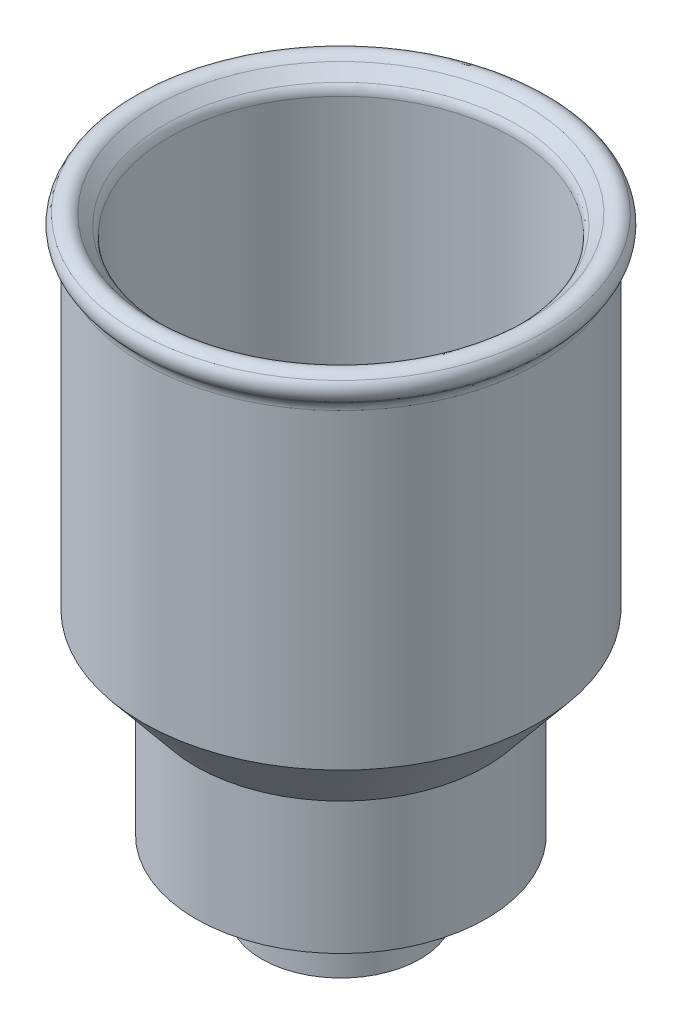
ISO-10303-21;
HEADER;
FILE_DESCRIPTION(('STEP AP214'),'2;1');
FILE_NAME('part.step','',(''),(''),'','','');
FILE_SCHEMA(('AUTOMOTIVE_DESIGN { 1 0 10303 214 1 1 1 1 }'));
ENDSEC;
DATA;
#1=APPLICATION_CONTEXT('core data for automotive mechanical design processes');
#2=APPLICATION_PROTOCOL_DEFINITION('international standard','automotive_design',2000,#1);
#3=PRODUCT_CONTEXT('',#1,'mechanical');
#4=PRODUCT('Part','Part','',(#3));
#5=PRODUCT_RELATED_PRODUCT_CATEGORY('part','',(#4));
#6=PRODUCT_DEFINITION_FORMATION('','',#4);
#7=PRODUCT_DEFINITION_CONTEXT('part definition',#1,'design');
#8=PRODUCT_DEFINITION('design','',#6,#7);
#9=PRODUCT_DEFINITION_SHAPE('','',#8);
#10=(LENGTH_UNIT() NAMED_UNIT(*) SI_UNIT(.MILLI.,.METRE.));
#11=(NAMED_UNIT(*) PLANE_ANGLE_UNIT() SI_UNIT($,.RADIAN.));
#12=(NAMED_UNIT(*) SI_UNIT($,.STERADIAN.) SOLID_ANGLE_UNIT());
#13=UNCERTAINTY_MEASURE_WITH_UNIT(LENGTH_MEASURE(1.E-05),#10,'distance_accuracy_value','');
#14=(GEOMETRIC_REPRESENTATION_CONTEXT(3) GLOBAL_UNCERTAINTY_ASSIGNED_CONTEXT((#13)) GLOBAL_UNIT_ASSIGNED_CONTEXT((#10,
#11,#12)) REPRESENTATION_CONTEXT('',''));
#15=CARTESIAN_POINT('',(0.,0.,0.));
#16=DIRECTION('',(0.,0.,1.));
#17=DIRECTION('',(1.,0.,0.));
#18=AXIS2_PLACEMENT_3D('',#15,#16,#17);
#19=CARTESIAN_POINT('',(3.88902869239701,27.8652560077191,0.));
#20=DIRECTION('',(0.,1.,0.));
#21=DIRECTION('',(0.,0.,1.));
#22=AXIS2_PLACEMENT_3D('',#19,#20,#21);
#23=CONICAL_SURFACE('',#22,6.5,0.785398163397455);
#24=CARTESIAN_POINT('',(3.88902869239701,28.0117026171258,0.));
#25=DIRECTION('',(0.,-1.,0.));
#26=DIRECTION('',(0.,0.,-1.));
#27=AXIS2_PLACEMENT_3D('',#24,#25,#26);
#28=CIRCLE('',#27,6.64644660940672);
#29=CARTESIAN_POINT('',(3.88902869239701,28.0117026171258,-6.64644660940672));
#30=VERTEX_POINT('',#29);
#31=EDGE_CURVE('E43',#30,#30,#28,.T.);
#32=ORIENTED_EDGE('',*,*,#31,.T.);
#33=EDGE_LOOP('',(#32));
#34=FACE_BOUND('',#33,.T.);
#35=CARTESIAN_POINT('',(3.88902869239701,28.4106623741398,0.));
#36=DIRECTION('',(0.,1.,0.));
#37=DIRECTION('',(0.,0.,1.));
#38=AXIS2_PLACEMENT_3D('',#35,#36,#37);
#39=CIRCLE('',#38,7.04540636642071);
#40=CARTESIAN_POINT('',(3.88902869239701,28.4106623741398,7.04540636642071));
#41=VERTEX_POINT('',#40);
#42=EDGE_CURVE('E48',#41,#41,#39,.T.);
#43=ORIENTED_EDGE('',*,*,#42,.T.);
#44=EDGE_LOOP('',(#43));
#45=FACE_BOUND('',#44,.T.);
#46=ADVANCED_FACE('F29',(#34,#45),#23,.F.);
#47=CARTESIAN_POINT('',(3.88902869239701,30.3420069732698,0.));
#48=DIRECTION('',(0.,1.,0.));
#49=DIRECTION('',(0.,0.,1.));
#50=AXIS2_PLACEMENT_3D('',#47,#48,#49);
#51=CYLINDRICAL_SURFACE('',#50,6.5);
#52=CARTESIAN_POINT('',(3.88902869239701,27.6581492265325,0.));
#53=DIRECTION('',(0.,-1.,0.));
#54=DIRECTION('',(0.,0.,-1.));
#55=AXIS2_PLACEMENT_3D('',#52,#53,#54);
#56=CIRCLE('',#55,6.5);
#57=CARTESIAN_POINT('',(3.88902869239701,27.6581492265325,-6.5));
#58=VERTEX_POINT('',#57);
#59=EDGE_CURVE('E51',#58,#58,#56,.F.);
#60=ORIENTED_EDGE('',*,*,#59,.T.);
#61=EDGE_LOOP('',(#60));
#62=FACE_BOUND('',#61,.T.);
#63=CARTESIAN_POINT('',(3.88902869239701,15.8097667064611,0.));
#64=DIRECTION('',(0.,1.,0.));
#65=DIRECTION('',(0.,0.,1.));
#66=AXIS2_PLACEMENT_3D('',#63,#64,#65);
#67=CIRCLE('',#66,6.5);
#68=CARTESIAN_POINT('',(3.88902869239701,15.8097667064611,6.5));
#69=VERTEX_POINT('',#68);
#70=EDGE_CURVE('E54',#69,#69,#67,.T.);
#71=ORIENTED_EDGE('',*,*,#70,.F.);
#72=EDGE_LOOP('',(#71));
#73=FACE_BOUND('',#72,.T.);
#74=ADVANCED_FACE('F107',(#62,#73),#51,.F.);
#75=CARTESIAN_POINT('',(3.88902869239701,13.3808345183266,0.));
#76=DIRECTION('',(0.,1.,0.));
#77=DIRECTION('',(0.,0.,1.));
#78=AXIS2_PLACEMENT_3D('',#75,#76,#77);
#79=CONICAL_SURFACE('',#78,4.49999999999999,0.688851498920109);
#80=ORIENTED_EDGE('',*,*,#70,.T.);
#81=EDGE_LOOP('',(#80));
#82=FACE_BOUND('',#81,.T.);
#83=CARTESIAN_POINT('',(3.88902869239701,13.3808345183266,0.));
#84=DIRECTION('',(0.,1.,0.));
#85=DIRECTION('',(0.,0.,1.));
#86=AXIS2_PLACEMENT_3D('',#83,#84,#85);
#87=CIRCLE('',#86,4.49999999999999);
#88=CARTESIAN_POINT('',(3.88902869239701,13.3808345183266,4.49999999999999));
#89=VERTEX_POINT('',#88);
#90=EDGE_CURVE('E57',#89,#89,#87,.T.);
#91=ORIENTED_EDGE('',*,*,#90,.F.);
#92=EDGE_LOOP('',(#91));
#93=FACE_BOUND('',#92,.T.);
#94=ADVANCED_FACE('F112',(#82,#93),#79,.F.);
#95=CARTESIAN_POINT('',(3.88902869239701,30.3420069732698,0.));
#96=DIRECTION('',(0.,1.,0.));
#97=DIRECTION('',(0.,0.,1.));
#98=AXIS2_PLACEMENT_3D('',#95,#96,#97);
#99=CYLINDRICAL_SURFACE('',#98,4.49999999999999);
#100=ORIENTED_EDGE('',*,*,#90,.T.);
#101=EDGE_LOOP('',(#100));
#102=FACE_BOUND('',#101,.T.);
#103=CARTESIAN_POINT('',(3.88902869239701,9.02211025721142,0.));
#104=DIRECTION('',(0.,1.,0.));
#105=DIRECTION('',(0.,0.,1.));
#106=AXIS2_PLACEMENT_3D('',#103,#104,#105);
#107=CIRCLE('',#106,4.49999999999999);
#108=CARTESIAN_POINT('',(3.88902869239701,9.02211025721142,4.49999999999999));
#109=VERTEX_POINT('',#108);
#110=EDGE_CURVE('E60',#109,#109,#107,.T.);
#111=ORIENTED_EDGE('',*,*,#110,.F.);
#112=EDGE_LOOP('',(#111));
#113=FACE_BOUND('',#112,.T.);
#114=ADVANCED_FACE('F124',(#102,#113),#99,.F.);
#115=CARTESIAN_POINT('',(0.889028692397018,9.02211025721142,0.));
#116=DIRECTION('',(0.,1.,0.));
#117=DIRECTION('',(0.,0.,1.));
#118=AXIS2_PLACEMENT_3D('',#115,#116,#117);
#119=PLANE('',#118);
#120=ORIENTED_EDGE('',*,*,#110,.T.);
#121=EDGE_LOOP('',(#120));
#122=FACE_BOUND('',#121,.T.);
#123=CARTESIAN_POINT('',(3.88902869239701,9.02211025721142,0.));
#124=DIRECTION('',(0.,1.,0.));
#125=DIRECTION('',(0.,0.,1.));
#126=AXIS2_PLACEMENT_3D('',#123,#124,#125);
#127=CIRCLE('',#126,2.);
#128=CARTESIAN_POINT('',(3.88902869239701,9.02211025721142,2.));
#129=VERTEX_POINT('',#128);
#130=EDGE_CURVE('E63',#129,#129,#127,.T.);
#131=ORIENTED_EDGE('',*,*,#130,.F.);
#132=EDGE_LOOP('',(#131));
#133=FACE_BOUND('',#132,.T.);
#134=ADVANCED_FACE('F130',(#122,#133),#119,.T.);
#135=CARTESIAN_POINT('',(3.88902869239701,30.3420069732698,0.));
#136=DIRECTION('',(0.,1.,0.));
#137=DIRECTION('',(0.,0.,1.));
#138=AXIS2_PLACEMENT_3D('',#135,#136,#137);
#139=CYLINDRICAL_SURFACE('',#138,2.);
#140=ORIENTED_EDGE('',*,*,#130,.T.);
#141=EDGE_LOOP('',(#140));
#142=FACE_BOUND('',#141,.T.);
#143=CARTESIAN_POINT('',(3.88902869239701,5.45104244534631,0.));
#144=DIRECTION('',(0.,1.,0.));
#145=DIRECTION('',(0.,0.,1.));
#146=AXIS2_PLACEMENT_3D('',#143,#144,#145);
#147=CIRCLE('',#146,2.);
#148=CARTESIAN_POINT('',(3.88902869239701,5.45104244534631,2.));
#149=VERTEX_POINT('',#148);
#150=EDGE_CURVE('E66',#149,#149,#147,.T.);
#151=ORIENTED_EDGE('',*,*,#150,.F.);
#152=EDGE_LOOP('',(#151));
#153=FACE_BOUND('',#152,.T.);
#154=ADVANCED_FACE('F136',(#142,#153),#139,.F.);
#155=CARTESIAN_POINT('',(1.88902869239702,5.45104244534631,0.));
#156=DIRECTION('',(0.,1.,0.));
#157=DIRECTION('',(0.,0.,1.));
#158=AXIS2_PLACEMENT_3D('',#155,#156,#157);
#159=PLANE('',#158);
#160=CARTESIAN_POINT('',(3.88902869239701,5.45104244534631,0.));
#161=DIRECTION('',(0.,1.,0.));
#162=DIRECTION('',(0.,0.,1.));
#163=AXIS2_PLACEMENT_3D('',#160,#161,#162);
#164=CIRCLE('',#163,3.);
#165=CARTESIAN_POINT('',(3.88902869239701,5.45104244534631,3.));
#166=VERTEX_POINT('',#165);
#167=EDGE_CURVE('E69',#166,#166,#164,.T.);
#168=ORIENTED_EDGE('',*,*,#167,.F.);
#169=EDGE_LOOP('',(#168));
#170=FACE_BOUND('',#169,.T.);
#171=ORIENTED_EDGE('',*,*,#150,.T.);
#172=EDGE_LOOP('',(#171));
#173=FACE_BOUND('',#172,.T.);
#174=ADVANCED_FACE('F142',(#170,#173),#159,.F.);
#175=CARTESIAN_POINT('',(3.88902869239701,30.3420069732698,0.));
#176=DIRECTION('',(0.,1.,0.));
#177=DIRECTION('',(0.,0.,1.));
#178=AXIS2_PLACEMENT_3D('',#175,#176,#177);
#179=CYLINDRICAL_SURFACE('',#178,3.);
#180=CARTESIAN_POINT('',(3.88902869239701,8.02211025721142,0.));
#181=DIRECTION('',(0.,1.,0.));
#182=DIRECTION('',(0.,0.,1.));
#183=AXIS2_PLACEMENT_3D('',#180,#181,#182);
#184=CIRCLE('',#183,3.);
#185=CARTESIAN_POINT('',(3.88902869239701,8.02211025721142,3.));
#186=VERTEX_POINT('',#185);
#187=EDGE_CURVE('E72',#186,#186,#184,.T.);
#188=ORIENTED_EDGE('',*,*,#187,.F.);
#189=EDGE_LOOP('',(#188));
#190=FACE_BOUND('',#189,.T.);
#191=ORIENTED_EDGE('',*,*,#167,.T.);
#192=EDGE_LOOP('',(#191));
#193=FACE_BOUND('',#192,.T.);
#194=ADVANCED_FACE('F147',(#190,#193),#179,.T.);
#195=CARTESIAN_POINT('',(0.889028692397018,8.02211025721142,0.));
#196=DIRECTION('',(0.,1.,0.));
#197=DIRECTION('',(0.,0.,1.));
#198=AXIS2_PLACEMENT_3D('',#195,#196,#197);
#199=PLANE('',#198);
#200=CARTESIAN_POINT('',(3.88902869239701,8.02211025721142,0.));
#201=DIRECTION('',(0.,1.,0.));
#202=DIRECTION('',(0.,0.,1.));
#203=AXIS2_PLACEMENT_3D('',#200,#201,#202);
#204=CIRCLE('',#203,5.49999999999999);
#205=CARTESIAN_POINT('',(3.88902869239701,8.02211025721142,5.49999999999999));
#206=VERTEX_POINT('',#205);
#207=EDGE_CURVE('E75',#206,#206,#204,.T.);
#208=ORIENTED_EDGE('',*,*,#207,.F.);
#209=EDGE_LOOP('',(#208));
#210=FACE_BOUND('',#209,.T.);
#211=ORIENTED_EDGE('',*,*,#187,.T.);
#212=EDGE_LOOP('',(#211));
#213=FACE_BOUND('',#212,.T.);
#214=ADVANCED_FACE('F153',(#210,#213),#199,.F.);
#215=CARTESIAN_POINT('',(3.88902869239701,30.3420069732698,0.));
#216=DIRECTION('',(0.,1.,0.));
#217=DIRECTION('',(0.,0.,1.));
#218=AXIS2_PLACEMENT_3D('',#215,#216,#217);
#219=CYLINDRICAL_SURFACE('',#218,5.49999999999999);
#220=CARTESIAN_POINT('',(3.88902869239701,13.0221102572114,0.));
#221=DIRECTION('',(0.,1.,0.));
#222=DIRECTION('',(0.,0.,1.));
#223=AXIS2_PLACEMENT_3D('',#220,#221,#222);
#224=CIRCLE('',#223,5.49999999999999);
#225=CARTESIAN_POINT('',(3.88902869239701,13.0221102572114,5.49999999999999));
#226=VERTEX_POINT('',#225);
#227=EDGE_CURVE('E78',#226,#226,#224,.T.);
#228=ORIENTED_EDGE('',*,*,#227,.F.);
#229=EDGE_LOOP('',(#228));
#230=FACE_BOUND('',#229,.T.);
#231=ORIENTED_EDGE('',*,*,#207,.T.);
#232=EDGE_LOOP('',(#231));
#233=FACE_BOUND('',#232,.T.);
#234=ADVANCED_FACE('F160',(#230,#233),#219,.T.);
#235=CARTESIAN_POINT('',(3.88902869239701,13.0221102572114,0.));
#236=DIRECTION('',(0.,1.,0.));
#237=DIRECTION('',(0.,0.,1.));
#238=AXIS2_PLACEMENT_3D('',#235,#236,#237);
#239=CONICAL_SURFACE('',#238,5.49999999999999,0.688851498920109);
#240=CARTESIAN_POINT('',(3.88902869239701,15.4510424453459,0.));
#241=DIRECTION('',(0.,1.,0.));
#242=DIRECTION('',(0.,0.,1.));
#243=AXIS2_PLACEMENT_3D('',#240,#241,#242);
#244=CIRCLE('',#243,7.5);
#245=CARTESIAN_POINT('',(3.88902869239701,15.4510424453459,7.5));
#246=VERTEX_POINT('',#245);
#247=EDGE_CURVE('E81',#246,#246,#244,.T.);
#248=ORIENTED_EDGE('',*,*,#247,.F.);
#249=EDGE_LOOP('',(#248));
#250=FACE_BOUND('',#249,.T.);
#251=ORIENTED_EDGE('',*,*,#227,.T.);
#252=EDGE_LOOP('',(#251));
#253=FACE_BOUND('',#252,.T.);
#254=ADVANCED_FACE('F164',(#250,#253),#239,.T.);
#255=CARTESIAN_POINT('',(3.88902869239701,30.3420069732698,0.));
#256=DIRECTION('',(0.,1.,0.));
#257=DIRECTION('',(0.,0.,1.));
#258=AXIS2_PLACEMENT_3D('',#255,#256,#257);
#259=CYLINDRICAL_SURFACE('',#258,7.5);
#260=CARTESIAN_POINT('',(3.88902869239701,27.2439356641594,0.));
#261=DIRECTION('',(0.,1.,0.));
#262=DIRECTION('',(0.,0.,1.));
#263=AXIS2_PLACEMENT_3D('',#260,#261,#262);
#264=CIRCLE('',#263,7.5);
#265=CARTESIAN_POINT('',(3.88902869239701,27.2439356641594,7.5));
#266=VERTEX_POINT('',#265);
#267=EDGE_CURVE('E10',#266,#266,#264,.F.);
#268=ORIENTED_EDGE('',*,*,#267,.T.);
#269=EDGE_LOOP('',(#268));
#270=FACE_BOUND('',#269,.T.);
#271=ORIENTED_EDGE('',*,*,#247,.T.);
#272=EDGE_LOOP('',(#271));
#273=FACE_BOUND('',#272,.T.);
#274=ADVANCED_FACE('F168',(#270,#273),#259,.T.);
#275=CARTESIAN_POINT('',(3.88902869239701,27.4510424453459,0.));
#276=DIRECTION('',(0.,1.,0.));
#277=DIRECTION('',(0.,0.,1.));
#278=AXIS2_PLACEMENT_3D('',#275,#276,#277);
#279=CONICAL_SURFACE('',#278,7.5,0.785398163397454);
#280=CARTESIAN_POINT('',(3.88902869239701,27.5974890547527,0.));
#281=DIRECTION('',(0.,1.,0.));
#282=DIRECTION('',(0.,0.,1.));
#283=AXIS2_PLACEMENT_3D('',#280,#281,#282);
#284=CIRCLE('',#283,7.64644660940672);
#285=CARTESIAN_POINT('',(3.88902869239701,27.5974890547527,7.64644660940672));
#286=VERTEX_POINT('',#285);
#287=EDGE_CURVE('E35',#286,#286,#284,.T.);
#288=ORIENTED_EDGE('',*,*,#287,.T.);
#289=EDGE_LOOP('',(#288));
#290=FACE_BOUND('',#289,.T.);
#291=CARTESIAN_POINT('',(3.88902869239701,27.7035555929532,0.));
#292=DIRECTION('',(0.,-1.,0.));
#293=DIRECTION('',(0.,0.,-1.));
#294=AXIS2_PLACEMENT_3D('',#291,#292,#293);
#295=CIRCLE('',#294,7.75251314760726);
#296=CARTESIAN_POINT('',(3.88902869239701,27.7035555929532,-7.75251314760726));
#297=VERTEX_POINT('',#296);
#298=EDGE_CURVE('E39',#297,#297,#295,.T.);
#299=ORIENTED_EDGE('',*,*,#298,.T.);
#300=EDGE_LOOP('',(#299));
#301=FACE_BOUND('',#300,.T.);
#302=ADVANCED_FACE('F102',(#290,#301),#279,.T.);
#303=CARTESIAN_POINT('',(3.88902869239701,27.6581492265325,0.));
#304=DIRECTION('',(0.,-1.,0.));
#305=DIRECTION('',(0.,0.,-1.));
#306=AXIS2_PLACEMENT_3D('',#303,#304,#305);
#307=TOROIDAL_SURFACE('',#306,7.,0.5);
#308=ORIENTED_EDGE('',*,*,#31,.F.);
#309=EDGE_LOOP('',(#308));
#310=FACE_BOUND('',#309,.T.);
#311=ORIENTED_EDGE('',*,*,#59,.F.);
#312=EDGE_LOOP('',(#311));
#313=FACE_BOUND('',#312,.T.);
#314=ADVANCED_FACE('F93',(#310,#313),#307,.T.);
#315=CARTESIAN_POINT('',(3.88902869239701,28.0571089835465,0.));
#316=DIRECTION('',(0.,-1.,0.));
#317=DIRECTION('',(0.,0.,-1.));
#318=AXIS2_PLACEMENT_3D('',#315,#316,#317);
#319=TOROIDAL_SURFACE('',#318,7.39895975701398,0.5);
#320=ORIENTED_EDGE('',*,*,#298,.F.);
#321=EDGE_LOOP('',(#320));
#322=FACE_BOUND('',#321,.T.);
#323=CARTESIAN_POINT('',(3.88902869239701,28.4106623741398,0.));
#324=DIRECTION('',(0.,1.,0.));
#325=DIRECTION('',(0.,0.,1.));
#326=AXIS2_PLACEMENT_3D('',#323,#324,#325);
#327=CIRCLE('',#326,7.75251314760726);
#328=CARTESIAN_POINT('',(3.88902869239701,28.4106623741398,7.75251314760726));
#329=VERTEX_POINT('',#328);
#330=EDGE_CURVE('E84',#329,#329,#327,.T.);
#331=ORIENTED_EDGE('',*,*,#330,.F.);
#332=EDGE_LOOP('',(#331));
#333=FACE_BOUND('',#332,.T.);
#334=ADVANCED_FACE('F91',(#322,#333),#319,.T.);
#335=CARTESIAN_POINT('',(3.88902869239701,28.0571089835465,0.));
#336=DIRECTION('',(0.,-1.,0.));
#337=DIRECTION('',(0.,0.,-1.));
#338=AXIS2_PLACEMENT_3D('',#335,#336,#337);
#339=TOROIDAL_SURFACE('',#338,7.39895975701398,0.5);
#340=ORIENTED_EDGE('',*,*,#330,.T.);
#341=EDGE_LOOP('',(#340));
#342=FACE_BOUND('',#341,.T.);
#343=ORIENTED_EDGE('',*,*,#42,.F.);
#344=EDGE_LOOP('',(#343));
#345=FACE_BOUND('',#344,.T.);
#346=ADVANCED_FACE('F88',(#342,#345),#339,.T.);
#347=CARTESIAN_POINT('',(3.88902869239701,27.2439356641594,0.));
#348=DIRECTION('',(0.,1.,0.));
#349=DIRECTION('',(0.,0.,1.));
#350=AXIS2_PLACEMENT_3D('',#347,#348,#349);
#351=TOROIDAL_SURFACE('',#350,8.,0.5);
#352=ORIENTED_EDGE('',*,*,#267,.F.);
#353=EDGE_LOOP('',(#352));
#354=FACE_BOUND('',#353,.T.);
#355=ORIENTED_EDGE('',*,*,#287,.F.);
#356=EDGE_LOOP('',(#355));
#357=FACE_BOUND('',#356,.T.);
#358=ADVANCED_FACE('F100',(#354,#357),#351,.F.);
#359=CLOSED_SHELL('',(#46,#74,#94,#114,#134,#154,#174,#194,#214,#234,#254,#274,#302,#314,#334,
#346,#358));
#360=MANIFOLD_SOLID_BREP('B2',#359);
#361=ADVANCED_BREP_SHAPE_REPRESENTATION('',(#18,#360),#14);
#362=SHAPE_DEFINITION_REPRESENTATION(#9,#361);
ENDSEC;
END-ISO-10303-21;
